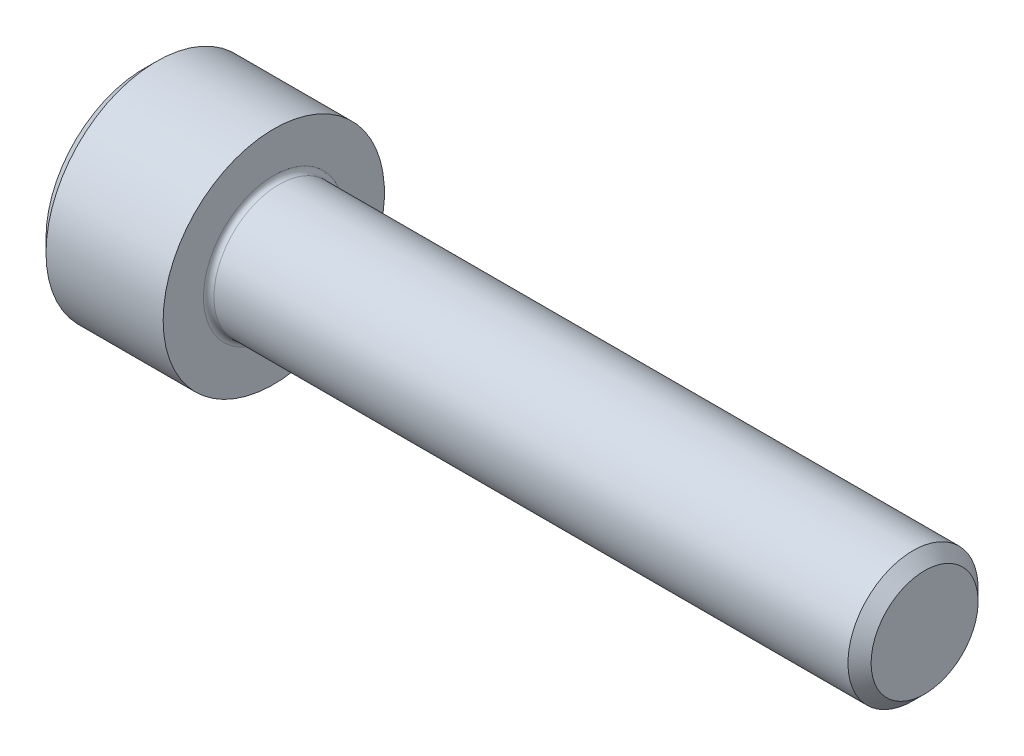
from build123d import *

# Parameters (mm, degrees)
FILLET1_R   = 0.2
HEX_2_DEPTH = 2.5


with BuildPart() as part:
    # BodySke → Base-Revolve (revolve)
    with BuildSketch(Plane.XY, mode=Mode.PRIVATE) as base_revolve_sk:
        Polygon((0, 0), (0, 3.75), (0.5, 4.25), (5, 4.25), (5, 2.5), (29.555, 2.5), (30, 2.055), (30, 0), align=None)
    revolve(base_revolve_sk.sketch.rotate(Axis((-31.75, 0, 0), (1, 0, 0)), 90), axis=Axis((-31.75, 0, 0), (1, 0, 0)))

    # Fillet1
    fillet1_edges = [part.edges().sort_by_distance(p)[0] for p in [
        (5, 0, -2.5),
    ]]
    fillet(fillet1_edges, radius=FILLET1_R)

    # Sketch2 → Hex-PreBroach (revolve, cut)
    with BuildSketch(Plane.XY, mode=Mode.PRIVATE) as hex_prebroach_sk:
        Polygon((0, 2.042), (2.5, 2.042), (3.67894925, 0), (0, 0), align=None)
    revolve(hex_prebroach_sk.sketch.rotate(Axis((0, 0, 0), (1, 0, 0)), 90), axis=Axis((0, 0, 0), (1, 0, 0)), mode=Mode.SUBTRACT)

    # Sketch3 → Hex 2 (cut)
    with BuildSketch(Plane(origin=(0, 0, 0), x_dir=(0, 0.500000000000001, 0.866025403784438), z_dir=(-1, 0, 0))):
        Polygon((1.17894925, 2.042), (-1.17894925, 2.042), (-2.357898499, 0), (-1.17894925, -2.042), (1.17894925, -2.042), (2.357898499, 0), align=None)
    extrude(amount=-HEX_2_DEPTH, mode=Mode.SUBTRACT)


solid = part.part
